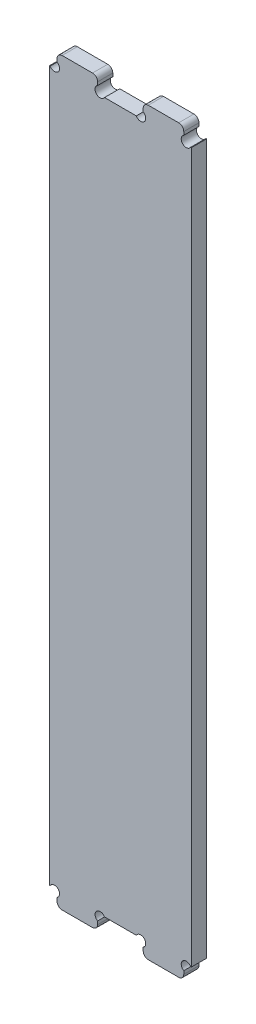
from build123d import *

# Parameters (mm, degrees)
SKETCH_1_W            = 28
SKETCH_1_H            = 140
EXTRUDE_1_DEPTH       = 3
SKETCH_2_W            = 8
SKETCH_2_H            = 3
EXTRUDE_2_DEPTH       = 3
HOLE_WIZARD_2_0_2_1_D = 2
FILLET_1_R            = 1


with BuildPart() as part:
    # Sketch 1 → Extrude 1 (new body)
    with BuildSketch(Plane.XY):
        Rectangle(SKETCH_1_W, SKETCH_1_H)
    extrude(amount=EXTRUDE_1_DEPTH)

    # Sketch 2 → Extrude 2 (add)
    with BuildSketch(Plane.XY.offset(3)):
        with Locations((-8.5, 71.5)):
            Rectangle(SKETCH_2_W, SKETCH_2_H)
        with Locations((8.5, 71.5)):
            Rectangle(SKETCH_2_W, SKETCH_2_H)
        with Locations((8.5, -71.5)):
            Rectangle(SKETCH_2_W, SKETCH_2_H)
        with Locations((-8.5, -71.5)):
            Rectangle(SKETCH_2_W, SKETCH_2_H)
    extrude(amount=-EXTRUDE_2_DEPTH)

    # Hole Wizard 2.0 _2_ _1 (through all)
    with Locations(Plane.XY.offset(3)):
        with Locations((-4, 70.5), (-13, 70.5), (13, 70.5), (4, 70.5), (4, -70.5), (13, -70.5), (-13, -70.5), (-4, -70.5)):
            Hole(HOLE_WIZARD_2_0_2_1_D / 2)

    # Fillet 1
    fillet_1_edges = [part.edges().sort_by_distance(p)[0] for p in [
        (-12.5, 73, 1.5),
        (-4.5, 73, 1.5),
        (4.5, 73, 1.5),
        (12.5, 73, 1.5),
        (12.5, -73, 1.5),
        (4.5, -73, 1.5),
        (-4.5, -73, 1.5),
        (-12.5, -73, 1.5),
    ]]
    fillet(fillet_1_edges, radius=FILLET_1_R)


solid = part.part
